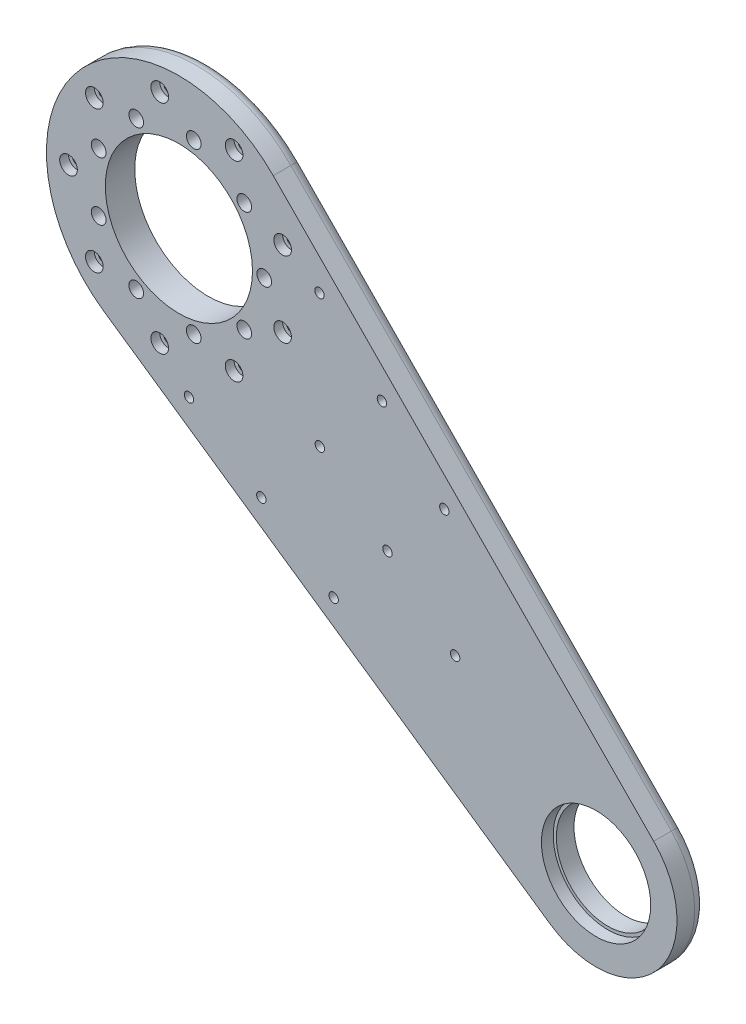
from build123d import *

# Parameters (mm, degrees)
SKETCH1_R           = 17.5
SKETCH1_R_2         = 1.6
BOSS_EXTRUDE1_DEPTH = 10
SKETCH2_R           = 25
SKETCH2_R_2         = 2.5
SKETCH2_R_3         = 1.6
CUT_EXTRUDE1_DEPTH  = 224.991888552
SKETCH3_R           = 18.5625
CUT_EXTRUDE2_DEPTH  = 4
SKETCH4_R           = 3
CUT_EXTRUDE3_DEPTH  = 3
FILLET1_R           = 4


with BuildPart() as part:
    # Sketch1 → Boss-Extrude1 (new body)
    with BuildSketch(Plane.XY):
        with BuildLine():
            Line((-25.534872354, -37.053613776), (126.113577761, -141.559582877))
            ThreePointArc((126.113577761, -141.559582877), (162.784444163, -136.592367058), (161.308367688, -99.616065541))
            Line((161.308367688, -99.616065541), (32.056602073, 31.581232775))
            ThreePointArc((32.056602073, 31.581232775), (-34.47199994, 28.925442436), (-25.534872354, -37.053613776))
        make_face()
        with Locations((141.718221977, -118.915707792)):
            Circle(SKETCH1_R, mode=Mode.SUBTRACT)
        with Locations((70.859110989, -59.457853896)):
            Circle(SKETCH1_R_2, mode=Mode.SUBTRACT)
        with Locations((93.840444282, -78.741482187)):
            Circle(SKETCH1_R_2, mode=Mode.SUBTRACT)
        with Locations((47.877777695, -40.174225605)):
            Circle(SKETCH1_R_2, mode=Mode.SUBTRACT)
        with Locations((47.767990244, 4.946625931)):
            Circle(SKETCH1_R_2, mode=Mode.SUBTRACT)
        with Locations((3.423348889, -47.901259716)):
            Circle(SKETCH1_R_2, mode=Mode.SUBTRACT)
        with Locations((68.973861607, -16.273907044)):
            Circle(SKETCH1_R_2, mode=Mode.SUBTRACT)
        with Locations((90.17973297, -37.494440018)):
            Circle(SKETCH1_R_2, mode=Mode.SUBTRACT)
        with Locations((28.003855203, -65.100059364)):
            Circle(SKETCH1_R_2, mode=Mode.SUBTRACT)
        with Locations((52.584361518, -82.298859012)):
            Circle(SKETCH1_R_2, mode=Mode.SUBTRACT)
    extrude(amount=BOSS_EXTRUDE1_DEPTH)

    # Sketch2 → Cut-Extrude1 (cut, through all)
    with BuildSketch(Plane.XY.offset(10)):
        Circle(SKETCH2_R)
        with Locations((29, 0)):
            Circle(SKETCH2_R_2)
        with Locations((-37.5, 0)):
            Circle(SKETCH2_R_3)
        with Locations((-28.726666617, 24.104535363)):
            Circle(SKETCH2_R_3)
        with Locations((-6.511806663, 36.930290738)):
            Circle(SKETCH2_R_3)
        with Locations((18.75, 32.475952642)):
            Circle(SKETCH2_R_3)
        with Locations((35.238473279, 12.825755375)):
            Circle(SKETCH2_R_3)
        with Locations((35.238473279, -12.825755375)):
            Circle(SKETCH2_R_3)
        with Locations((18.75, -32.475952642)):
            Circle(SKETCH2_R_3)
        with Locations((-6.511806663, -36.930290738)):
            Circle(SKETCH2_R_3)
        with Locations((-28.726666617, -24.104535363)):
            Circle(SKETCH2_R_3)
        with Locations((22.21528885, -18.640840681)):
            Circle(SKETCH2_R_2)
        with Locations((5.035797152, -28.559424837)):
            Circle(SKETCH2_R_2)
        with Locations((-14.5, -25.11473671)):
            Circle(SKETCH2_R_2)
        with Locations((-27.251086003, -9.918584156)):
            Circle(SKETCH2_R_2)
        with Locations((-27.251086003, 9.918584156)):
            Circle(SKETCH2_R_2)
        with Locations((-14.5, 25.11473671)):
            Circle(SKETCH2_R_2)
        with Locations((5.035797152, 28.559424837)):
            Circle(SKETCH2_R_2)
        with Locations((22.21528885, 18.640840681)):
            Circle(SKETCH2_R_2)
    extrude(amount=-CUT_EXTRUDE1_DEPTH, mode=Mode.SUBTRACT)

    # Sketch3 → Cut-Extrude2 (cut)
    with BuildSketch(Plane.XY.offset(10)):
        with Locations((141.718221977, -118.915707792)):
            Circle(SKETCH3_R)
    extrude(amount=-CUT_EXTRUDE2_DEPTH, mode=Mode.SUBTRACT)

    # Sketch4 → Cut-Extrude3 (cut)
    with BuildSketch(Plane.XY.offset(10)):
        with Locations((-28.726666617, 24.104535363)):
            Circle(SKETCH4_R)
        with Locations((-6.511806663, 36.930290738)):
            Circle(SKETCH4_R)
        with Locations((18.75, 32.475952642)):
            Circle(SKETCH4_R)
        with Locations((35.238473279, 12.825755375)):
            Circle(SKETCH4_R)
        with Locations((35.238473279, -12.825755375)):
            Circle(SKETCH4_R)
        with Locations((18.75, -32.475952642)):
            Circle(SKETCH4_R)
        with Locations((-6.511806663, -36.930290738)):
            Circle(SKETCH4_R)
        with Locations((-28.726666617, -24.104535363)):
            Circle(SKETCH4_R)
        with Locations((-37.5, 0)):
            Circle(SKETCH4_R)
    extrude(amount=-CUT_EXTRUDE3_DEPTH, mode=Mode.SUBTRACT)

    # Fillet1
    fillet1_edges = [part.edges().sort_by_distance(p)[0] for p in [
        (96.68248488, -34.017416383, 0),
        (162.784444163, -136.592367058, 0),
        (50.289352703, -89.306598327, 0),
        (-34.47199994, 28.925442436, 0),
    ]]
    fillet(fillet1_edges, radius=FILLET1_R)


solid = part.part
